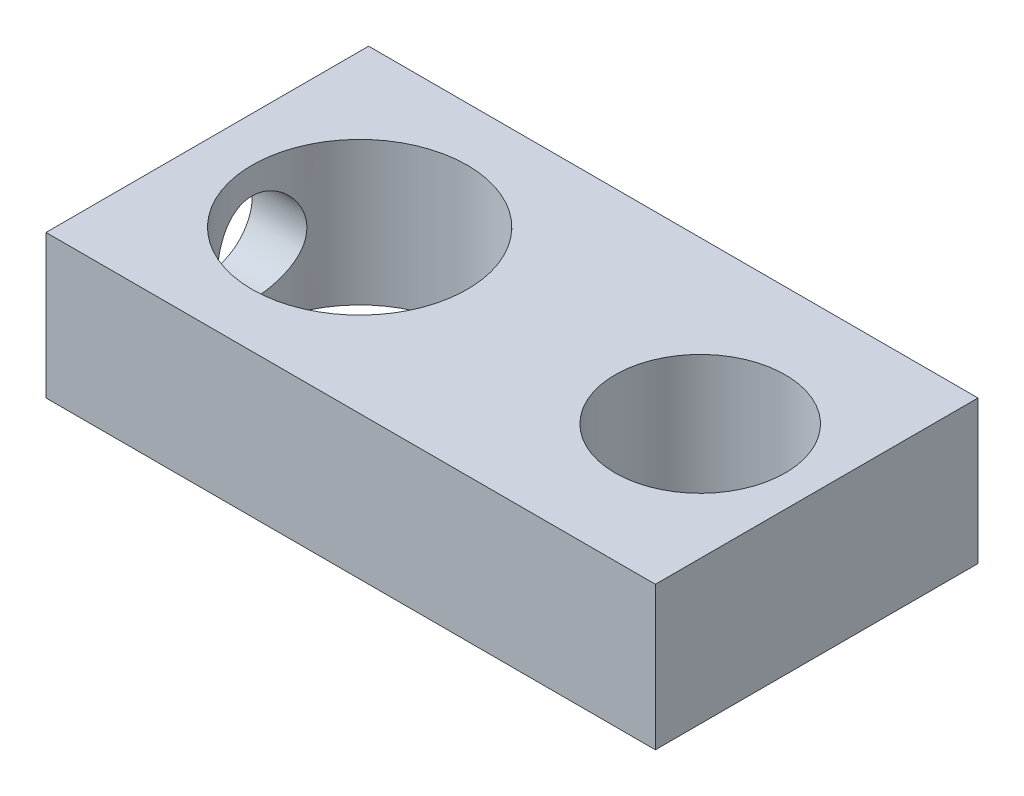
ISO-10303-21;
HEADER;
FILE_DESCRIPTION(('STEP AP214'),'2;1');
FILE_NAME('part.step','',(''),(''),'','','');
FILE_SCHEMA(('AUTOMOTIVE_DESIGN { 1 0 10303 214 1 1 1 1 }'));
ENDSEC;
DATA;
#1=APPLICATION_CONTEXT('core data for automotive mechanical design processes');
#2=APPLICATION_PROTOCOL_DEFINITION('international standard','automotive_design',2000,#1);
#3=PRODUCT_CONTEXT('',#1,'mechanical');
#4=PRODUCT('Part','Part','',(#3));
#5=PRODUCT_RELATED_PRODUCT_CATEGORY('part','',(#4));
#6=PRODUCT_DEFINITION_FORMATION('','',#4);
#7=PRODUCT_DEFINITION_CONTEXT('part definition',#1,'design');
#8=PRODUCT_DEFINITION('design','',#6,#7);
#9=PRODUCT_DEFINITION_SHAPE('','',#8);
#10=(LENGTH_UNIT() NAMED_UNIT(*) SI_UNIT(.MILLI.,.METRE.));
#11=(NAMED_UNIT(*) PLANE_ANGLE_UNIT() SI_UNIT($,.RADIAN.));
#12=(NAMED_UNIT(*) SI_UNIT($,.STERADIAN.) SOLID_ANGLE_UNIT());
#13=UNCERTAINTY_MEASURE_WITH_UNIT(LENGTH_MEASURE(1.E-05),#10,'distance_accuracy_value','');
#14=(GEOMETRIC_REPRESENTATION_CONTEXT(3) GLOBAL_UNCERTAINTY_ASSIGNED_CONTEXT((#13)) GLOBAL_UNIT_ASSIGNED_CONTEXT((#10,
#11,#12)) REPRESENTATION_CONTEXT('',''));
#15=CARTESIAN_POINT('',(0.,0.,0.));
#16=DIRECTION('',(0.,0.,1.));
#17=DIRECTION('',(1.,0.,0.));
#18=AXIS2_PLACEMENT_3D('',#15,#16,#17);
#19=CARTESIAN_POINT('',(-13.49375,12.6999999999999,14.2875));
#20=DIRECTION('',(0.,-1.,0.));
#21=DIRECTION('',(0.,0.,-1.));
#22=AXIS2_PLACEMENT_3D('',#19,#20,#21);
#23=PLANE('',#22);
#24=CARTESIAN_POINT('',(0.,12.6999999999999,0.));
#25=DIRECTION('',(0.,1.,0.));
#26=DIRECTION('',(0.,0.,1.));
#27=AXIS2_PLACEMENT_3D('',#24,#25,#26);
#28=CIRCLE('',#27,9.53262);
#29=CARTESIAN_POINT('',(0.,12.6999999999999,9.53262000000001));
#30=VERTEX_POINT('',#29);
#31=EDGE_CURVE('E100',#30,#30,#28,.T.);
#32=ORIENTED_EDGE('',*,*,#31,.F.);
#33=EDGE_LOOP('',(#32));
#34=FACE_BOUND('',#33,.T.);
#35=DIRECTION('',(0.,0.,1.));
#36=VECTOR('',#35,1.);
#37=CARTESIAN_POINT('',(-13.49375,12.6999999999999,14.2875));
#38=LINE('',#37,#36);
#39=CARTESIAN_POINT('',(-13.49375,12.6999999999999,-14.2875000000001));
#40=VERTEX_POINT('',#39);
#41=CARTESIAN_POINT('',(-13.49375,12.6999999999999,14.2875));
#42=VERTEX_POINT('',#41);
#43=EDGE_CURVE('E115',#40,#42,#38,.T.);
#44=ORIENTED_EDGE('',*,*,#43,.T.);
#45=DIRECTION('',(1.,0.,0.));
#46=VECTOR('',#45,1.);
#47=CARTESIAN_POINT('',(-13.49375,12.6999999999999,14.2875));
#48=LINE('',#47,#46);
#49=CARTESIAN_POINT('',(40.4812500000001,12.6999999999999,14.2875));
#50=VERTEX_POINT('',#49);
#51=EDGE_CURVE('E94',#42,#50,#48,.T.);
#52=ORIENTED_EDGE('',*,*,#51,.T.);
#53=DIRECTION('',(0.,0.,-1.));
#54=VECTOR('',#53,1.);
#55=CARTESIAN_POINT('',(40.4812500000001,12.6999999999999,-14.2875));
#56=LINE('',#55,#54);
#57=CARTESIAN_POINT('',(40.4812500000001,12.6999999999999,-14.2875));
#58=VERTEX_POINT('',#57);
#59=EDGE_CURVE('E59',#50,#58,#56,.T.);
#60=ORIENTED_EDGE('',*,*,#59,.T.);
#61=DIRECTION('',(-1.,0.,0.));
#62=VECTOR('',#61,1.);
#63=CARTESIAN_POINT('',(-13.49375,12.6999999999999,-14.2875000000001));
#64=LINE('',#63,#62);
#65=EDGE_CURVE('E54',#58,#40,#64,.T.);
#66=ORIENTED_EDGE('',*,*,#65,.T.);
#67=EDGE_LOOP('',(#44,#52,#60,#66));
#68=FACE_BOUND('',#67,.T.);
#69=CARTESIAN_POINT('',(30.1625,12.6999999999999,0.));
#70=DIRECTION('',(0.,1.,0.));
#71=DIRECTION('',(0.,0.,1.));
#72=AXIS2_PLACEMENT_3D('',#69,#70,#71);
#73=CIRCLE('',#72,7.53618);
#74=CARTESIAN_POINT('',(30.1625,12.6999999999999,7.53617999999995));
#75=VERTEX_POINT('',#74);
#76=EDGE_CURVE('E140',#75,#75,#73,.T.);
#77=ORIENTED_EDGE('',*,*,#76,.F.);
#78=EDGE_LOOP('',(#77));
#79=FACE_BOUND('',#78,.T.);
#80=ADVANCED_FACE('F32',(#34,#68,#79),#23,.F.);
#81=CARTESIAN_POINT('',(-13.49375,0.,14.2875));
#82=DIRECTION('',(0.,-1.,0.));
#83=DIRECTION('',(0.,0.,-1.));
#84=AXIS2_PLACEMENT_3D('',#81,#82,#83);
#85=PLANE('',#84);
#86=CARTESIAN_POINT('',(0.,0.,0.));
#87=DIRECTION('',(0.,1.,0.));
#88=DIRECTION('',(0.,0.,1.));
#89=AXIS2_PLACEMENT_3D('',#86,#87,#88);
#90=CIRCLE('',#89,9.53262);
#91=CARTESIAN_POINT('',(0.,0.,9.53262000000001));
#92=VERTEX_POINT('',#91);
#93=EDGE_CURVE('E107',#92,#92,#90,.T.);
#94=ORIENTED_EDGE('',*,*,#93,.T.);
#95=EDGE_LOOP('',(#94));
#96=FACE_BOUND('',#95,.T.);
#97=DIRECTION('',(0.,0.,1.));
#98=VECTOR('',#97,1.);
#99=CARTESIAN_POINT('',(-13.49375,0.,14.2875));
#100=LINE('',#99,#98);
#101=CARTESIAN_POINT('',(-13.49375,0.,-14.2875000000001));
#102=VERTEX_POINT('',#101);
#103=CARTESIAN_POINT('',(-13.49375,0.,14.2875));
#104=VERTEX_POINT('',#103);
#105=EDGE_CURVE('E85',#102,#104,#100,.T.);
#106=ORIENTED_EDGE('',*,*,#105,.F.);
#107=DIRECTION('',(-1.,0.,0.));
#108=VECTOR('',#107,1.);
#109=CARTESIAN_POINT('',(-13.49375,0.,-14.2875000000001));
#110=LINE('',#109,#108);
#111=CARTESIAN_POINT('',(40.4812500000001,0.,-14.2875000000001));
#112=VERTEX_POINT('',#111);
#113=EDGE_CURVE('E112',#112,#102,#110,.T.);
#114=ORIENTED_EDGE('',*,*,#113,.F.);
#115=DIRECTION('',(0.,0.,-1.));
#116=VECTOR('',#115,1.);
#117=CARTESIAN_POINT('',(40.4812500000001,0.,-14.2875000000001));
#118=LINE('',#117,#116);
#119=CARTESIAN_POINT('',(40.4812500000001,0.,14.2875));
#120=VERTEX_POINT('',#119);
#121=EDGE_CURVE('E86',#120,#112,#118,.T.);
#122=ORIENTED_EDGE('',*,*,#121,.F.);
#123=DIRECTION('',(1.,0.,0.));
#124=VECTOR('',#123,1.);
#125=CARTESIAN_POINT('',(-13.49375,0.,14.2875));
#126=LINE('',#125,#124);
#127=EDGE_CURVE('E80',#104,#120,#126,.T.);
#128=ORIENTED_EDGE('',*,*,#127,.F.);
#129=EDGE_LOOP('',(#106,#114,#122,#128));
#130=FACE_BOUND('',#129,.T.);
#131=CARTESIAN_POINT('',(30.1625,0.,0.));
#132=DIRECTION('',(0.,1.,0.));
#133=DIRECTION('',(0.,0.,1.));
#134=AXIS2_PLACEMENT_3D('',#131,#132,#133);
#135=CIRCLE('',#134,7.53618);
#136=CARTESIAN_POINT('',(30.1625,0.,7.53617999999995));
#137=VERTEX_POINT('',#136);
#138=EDGE_CURVE('E143',#137,#137,#135,.T.);
#139=ORIENTED_EDGE('',*,*,#138,.T.);
#140=EDGE_LOOP('',(#139));
#141=FACE_BOUND('',#140,.T.);
#142=ADVANCED_FACE('F81',(#96,#130,#141),#85,.T.);
#143=CARTESIAN_POINT('',(-13.49375,12.6999999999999,14.2875));
#144=DIRECTION('',(1.,0.,0.));
#145=DIRECTION('',(0.,0.,-1.));
#146=AXIS2_PLACEMENT_3D('',#143,#144,#145);
#147=PLANE('',#146);
#148=CARTESIAN_POINT('',(-13.49375,6.35000000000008,0.));
#149=DIRECTION('',(-1.,0.,0.));
#150=DIRECTION('',(0.,0.,1.));
#151=AXIS2_PLACEMENT_3D('',#148,#149,#150);
#152=CIRCLE('',#151,3.9878);
#153=CARTESIAN_POINT('',(-13.49375,6.35000000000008,3.98779999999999));
#154=VERTEX_POINT('',#153);
#155=EDGE_CURVE('E153',#154,#154,#152,.T.);
#156=ORIENTED_EDGE('',*,*,#155,.F.);
#157=EDGE_LOOP('',(#156));
#158=FACE_BOUND('',#157,.T.);
#159=ORIENTED_EDGE('',*,*,#105,.T.);
#160=DIRECTION('',(0.,-1.,0.));
#161=VECTOR('',#160,1.);
#162=CARTESIAN_POINT('',(-13.49375,12.6999999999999,14.2875));
#163=LINE('',#162,#161);
#164=EDGE_CURVE('E11',#42,#104,#163,.T.);
#165=ORIENTED_EDGE('',*,*,#164,.F.);
#166=ORIENTED_EDGE('',*,*,#43,.F.);
#167=DIRECTION('',(0.,-1.,0.));
#168=VECTOR('',#167,1.);
#169=CARTESIAN_POINT('',(-13.49375,12.6999999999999,-14.2875000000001));
#170=LINE('',#169,#168);
#171=EDGE_CURVE('E98',#40,#102,#170,.T.);
#172=ORIENTED_EDGE('',*,*,#171,.T.);
#173=EDGE_LOOP('',(#159,#165,#166,#172));
#174=FACE_BOUND('',#173,.T.);
#175=ADVANCED_FACE('F34',(#158,#174),#147,.F.);
#176=CARTESIAN_POINT('',(-13.49375,12.6999999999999,14.2875));
#177=DIRECTION('',(0.,0.,-1.));
#178=DIRECTION('',(-1.,0.,0.));
#179=AXIS2_PLACEMENT_3D('',#176,#177,#178);
#180=PLANE('',#179);
#181=ORIENTED_EDGE('',*,*,#127,.T.);
#182=DIRECTION('',(0.,-1.,0.));
#183=VECTOR('',#182,1.);
#184=CARTESIAN_POINT('',(40.4812500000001,12.6999999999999,14.2875));
#185=LINE('',#184,#183);
#186=EDGE_CURVE('E47',#50,#120,#185,.T.);
#187=ORIENTED_EDGE('',*,*,#186,.F.);
#188=ORIENTED_EDGE('',*,*,#51,.F.);
#189=ORIENTED_EDGE('',*,*,#164,.T.);
#190=EDGE_LOOP('',(#181,#187,#188,#189));
#191=FACE_BOUND('',#190,.T.);
#192=ADVANCED_FACE('F93',(#191),#180,.F.);
#193=CARTESIAN_POINT('',(40.4812500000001,12.6999999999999,-14.2875));
#194=DIRECTION('',(-1.,0.,0.));
#195=DIRECTION('',(0.,0.,1.));
#196=AXIS2_PLACEMENT_3D('',#193,#194,#195);
#197=PLANE('',#196);
#198=ORIENTED_EDGE('',*,*,#121,.T.);
#199=DIRECTION('',(0.,-1.,0.));
#200=VECTOR('',#199,1.);
#201=CARTESIAN_POINT('',(40.4812500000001,12.6999999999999,-14.2875));
#202=LINE('',#201,#200);
#203=EDGE_CURVE('E123',#58,#112,#202,.T.);
#204=ORIENTED_EDGE('',*,*,#203,.F.);
#205=ORIENTED_EDGE('',*,*,#59,.F.);
#206=ORIENTED_EDGE('',*,*,#186,.T.);
#207=EDGE_LOOP('',(#198,#204,#205,#206));
#208=FACE_BOUND('',#207,.T.);
#209=ADVANCED_FACE('F131',(#208),#197,.F.);
#210=CARTESIAN_POINT('',(-13.49375,12.6999999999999,-14.2875000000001));
#211=DIRECTION('',(0.,0.,1.));
#212=DIRECTION('',(1.,0.,0.));
#213=AXIS2_PLACEMENT_3D('',#210,#211,#212);
#214=PLANE('',#213);
#215=ORIENTED_EDGE('',*,*,#113,.T.);
#216=ORIENTED_EDGE('',*,*,#171,.F.);
#217=ORIENTED_EDGE('',*,*,#65,.F.);
#218=ORIENTED_EDGE('',*,*,#203,.T.);
#219=EDGE_LOOP('',(#215,#216,#217,#218));
#220=FACE_BOUND('',#219,.T.);
#221=ADVANCED_FACE('F133',(#220),#214,.F.);
#222=CARTESIAN_POINT('',(0.,12.6999999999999,0.));
#223=DIRECTION('',(0.,-1.,0.));
#224=DIRECTION('',(0.,0.,-1.));
#225=AXIS2_PLACEMENT_3D('',#222,#223,#224);
#226=CYLINDRICAL_SURFACE('',#225,9.53262);
#227=CARTESIAN_POINT('',(-8.65842336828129,6.35000000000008,3.98779999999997));
#228=CARTESIAN_POINT('',(-8.65842416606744,6.24364850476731,3.9877992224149));
#229=CARTESIAN_POINT('',(-8.66038974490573,6.13725943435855,3.98353913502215));
#230=CARTESIAN_POINT('',(-8.66818681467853,5.92525746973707,3.96654329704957));
#231=CARTESIAN_POINT('',(-8.67402081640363,5.81964512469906,3.95380204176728));
#232=CARTESIAN_POINT('',(-8.6893740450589,5.60980372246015,3.91994516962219));
#233=CARTESIAN_POINT('',(-8.69890106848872,5.505578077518,3.89881183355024));
#234=CARTESIAN_POINT('',(-8.72131774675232,5.29947002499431,3.84840396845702));
#235=CARTESIAN_POINT('',(-8.73420881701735,5.19758862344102,3.81912601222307));
#236=CARTESIAN_POINT('',(-8.77720692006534,4.89740949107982,3.71977542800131));
#237=CARTESIAN_POINT('',(-8.81172636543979,4.70347365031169,3.63800489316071));
#238=CARTESIAN_POINT('',(-8.88856326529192,4.3322294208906,3.44599985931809));
#239=CARTESIAN_POINT('',(-8.9308789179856,4.15491720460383,3.3357719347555));
#240=CARTESIAN_POINT('',(-9.02151716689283,3.81058934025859,3.08255361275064));
#241=CARTESIAN_POINT('',(-9.07004454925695,3.64473344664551,2.93805603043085));
#242=CARTESIAN_POINT('',(-9.16595452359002,3.3387570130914,2.62357269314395));
#243=CARTESIAN_POINT('',(-9.21333666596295,3.19864644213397,2.45357711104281));
#244=CARTESIAN_POINT('',(-9.30410937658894,2.94218781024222,2.08378222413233));
#245=CARTESIAN_POINT('',(-9.34723435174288,2.82714873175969,1.88300389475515));
#246=CARTESIAN_POINT('',(-9.4221256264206,2.63298296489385,1.46281474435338));
#247=CARTESIAN_POINT('',(-9.45389700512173,2.55384021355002,1.24341230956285));
#248=CARTESIAN_POINT('',(-9.50104928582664,2.43792937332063,0.804398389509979));
#249=CARTESIAN_POINT('',(-9.51720188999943,2.39915795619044,0.58540042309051));
#250=CARTESIAN_POINT('',(-9.53410124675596,2.35861500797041,0.14345148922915));
#251=CARTESIAN_POINT('',(-9.53485430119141,2.35682834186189,-0.0794978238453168));
#252=CARTESIAN_POINT('',(-9.52132247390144,2.38926080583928,-0.508445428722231));
#253=CARTESIAN_POINT('',(-9.50795714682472,2.42127815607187,-0.714644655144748));
#254=CARTESIAN_POINT('',(-9.46895546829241,2.51663246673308,-1.11843031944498));
#255=CARTESIAN_POINT('',(-9.44331821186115,2.57997173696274,-1.31601612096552));
#256=CARTESIAN_POINT('',(-9.38175658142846,2.7369218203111,-1.70059540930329));
#257=CARTESIAN_POINT('',(-9.34568112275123,2.83098004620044,-1.88738111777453));
#258=CARTESIAN_POINT('',(-9.26676814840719,3.04625753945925,-2.24300729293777));
#259=CARTESIAN_POINT('',(-9.22392823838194,3.16748643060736,-2.41184136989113));
#260=CARTESIAN_POINT('',(-9.13219174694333,3.44366820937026,-2.73950529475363));
#261=CARTESIAN_POINT('',(-9.08308109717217,3.60040394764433,-2.8967746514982));
#262=CARTESIAN_POINT('',(-8.98661592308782,3.93812635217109,-3.18347418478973));
#263=CARTESIAN_POINT('',(-8.93926209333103,4.11912248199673,-3.31289344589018));
#264=CARTESIAN_POINT('',(-8.85013643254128,4.50785008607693,-3.54427038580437));
#265=CARTESIAN_POINT('',(-8.80860346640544,4.71627193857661,-3.64516812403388));
#266=CARTESIAN_POINT('',(-8.73867255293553,5.14934716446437,-3.80979535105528));
#267=CARTESIAN_POINT('',(-8.71026512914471,5.37398869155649,-3.87355166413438));
#268=CARTESIAN_POINT('',(-8.67215722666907,5.81748539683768,-3.95810054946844));
#269=CARTESIAN_POINT('',(-8.66135707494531,6.03576172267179,-3.98142503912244));
#270=CARTESIAN_POINT('',(-8.65654195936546,6.47332963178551,-3.99188978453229));
#271=CARTESIAN_POINT('',(-8.66252111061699,6.69262083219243,-3.97904272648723));
#272=CARTESIAN_POINT('',(-8.68945401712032,7.11102643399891,-3.91984013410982));
#273=CARTESIAN_POINT('',(-8.70941289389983,7.31052778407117,-3.87570859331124));
#274=CARTESIAN_POINT('',(-8.76078126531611,7.6991265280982,-3.7581431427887));
#275=CARTESIAN_POINT('',(-8.79219345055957,7.88822146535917,-3.68470234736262));
#276=CARTESIAN_POINT('',(-8.86455526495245,8.25962662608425,-3.50714119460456));
#277=CARTESIAN_POINT('',(-8.90585360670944,8.44130658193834,-3.40184921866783));
#278=CARTESIAN_POINT('',(-8.99284246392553,8.78529702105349,-3.16473704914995));
#279=CARTESIAN_POINT('',(-9.03853488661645,8.94759902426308,-3.03290530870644));
#280=CARTESIAN_POINT('',(-9.13369502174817,9.26211085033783,-2.73368664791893));
#281=CARTESIAN_POINT('',(-9.18316437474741,9.41239492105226,-2.56426803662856));
#282=CARTESIAN_POINT('',(-9.27682132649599,9.68275098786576,-2.20147473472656));
#283=CARTESIAN_POINT('',(-9.32100851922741,9.80282066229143,-2.00809820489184));
#284=CARTESIAN_POINT('',(-9.39942506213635,10.0092432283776,-1.60143678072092));
#285=CARTESIAN_POINT('',(-9.43362546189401,10.0954983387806,-1.38809632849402));
#286=CARTESIAN_POINT('',(-9.48793383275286,10.2302622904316,-0.948133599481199));
#287=CARTESIAN_POINT('',(-9.50805026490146,10.2787937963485,-0.721519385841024));
#288=CARTESIAN_POINT('',(-9.53094382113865,10.3338619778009,-0.278648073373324));
#289=CARTESIAN_POINT('',(-9.53484138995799,10.3431132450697,-0.0627841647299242));
#290=CARTESIAN_POINT('',(-9.52796580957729,10.3266695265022,0.367346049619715));
#291=CARTESIAN_POINT('',(-9.51719526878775,10.3009807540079,0.581612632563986));
#292=CARTESIAN_POINT('',(-9.48278481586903,10.2173353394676,0.994517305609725));
#293=CARTESIAN_POINT('',(-9.45962178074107,10.1605726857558,1.1934403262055));
#294=CARTESIAN_POINT('',(-9.40297937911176,10.0176986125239,1.57886084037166));
#295=CARTESIAN_POINT('',(-9.36949806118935,9.93158164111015,1.76535597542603));
#296=CARTESIAN_POINT('',(-9.29357256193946,9.72809083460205,2.12992847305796));
#297=CARTESIAN_POINT('',(-9.25079126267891,9.60947854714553,2.30724262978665));
#298=CARTESIAN_POINT('',(-9.16132639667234,9.34615058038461,2.64021122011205));
#299=CARTESIAN_POINT('',(-9.11464137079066,9.20142511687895,2.79585749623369));
#300=CARTESIAN_POINT('',(-9.01860202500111,8.87829991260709,3.09217856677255));
#301=CARTESIAN_POINT('',(-8.96928460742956,8.69827001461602,3.23109076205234));
#302=CARTESIAN_POINT('',(-8.87684626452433,8.31580068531,3.4770378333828));
#303=CARTESIAN_POINT('',(-8.83372882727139,8.11334875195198,3.58405480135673));
#304=CARTESIAN_POINT('',(-8.77797291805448,7.79750310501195,3.71757032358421));
#305=CARTESIAN_POINT('',(-8.76089762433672,7.69040171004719,3.75752493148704));
#306=CARTESIAN_POINT('',(-8.73024799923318,7.47272523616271,3.82819856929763));
#307=CARTESIAN_POINT('',(-8.71667194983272,7.36215189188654,3.85892213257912));
#308=CARTESIAN_POINT('',(-8.69355945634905,7.13867479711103,3.91071226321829));
#309=CARTESIAN_POINT('',(-8.68401235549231,7.02577803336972,3.93180431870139));
#310=CARTESIAN_POINT('',(-8.66928332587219,6.79836169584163,3.96417600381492));
#311=CARTESIAN_POINT('',(-8.66409800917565,6.6838434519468,3.97546324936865));
#312=CARTESIAN_POINT('',(-8.66027106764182,6.53257728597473,3.98378598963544));
#313=CARTESIAN_POINT('',(-8.65957864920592,6.49608312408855,3.98529080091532));
#314=CARTESIAN_POINT('',(-8.65865466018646,6.42306078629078,3.98729794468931));
#315=CARTESIAN_POINT('',(-8.65842309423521,6.38653261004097,3.98780026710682));
#316=CARTESIAN_POINT('',(-8.65842336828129,6.35000000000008,3.98779999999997));
#317=B_SPLINE_CURVE_WITH_KNOTS('',3,(#227,#228,#229,#230,#231,#232,#233,#234,#235,#236,#237,
#238,#239,#240,#241,#242,#243,#244,#245,#246,#247,#248,#249,#250,#251,#252,#253,#254,#255,#256,
#257,#258,#259,#260,#261,#262,#263,#264,#265,#266,#267,#268,#269,#270,#271,#272,#273,#274,#275,
#276,#277,#278,#279,#280,#281,#282,#283,#284,#285,#286,#287,#288,#289,#290,#291,#292,#293,#294,
#295,#296,#297,#298,#299,#300,#301,#302,#303,#304,#305,#306,#307,#308,#309,#310,#311,#312,#313,
#314,#315,#316),.UNSPECIFIED.,.T.,.F.,(4,2,2,2,2,2,2,2,2,2,2,2,2,2,2,2,2,2,2,2,2,2,2,2,2,2,2,2,
2,2,2,2,2,2,2,2,2,2,2,2,2,2,2,2,4),(0.,0.319016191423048,0.638239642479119,0.958140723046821,
1.2781766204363,1.91492673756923,2.55152987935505,3.22435181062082,3.89743372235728,
4.59998524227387,5.30222207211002,5.9676575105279,6.63282063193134,7.25718437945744,
7.88159417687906,8.51553728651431,9.14970529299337,9.82888239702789,10.5083252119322,
11.2104303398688,11.9120277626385,12.5678463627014,13.2234349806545,13.8365657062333,
14.4498405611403,15.0891893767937,15.7288169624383,16.4210136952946,17.1132636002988,
17.8075007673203,18.5013205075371,19.1463212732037,19.7912073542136,20.4128954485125,
21.0347011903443,21.6846544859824,22.334851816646,23.0297079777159,23.7249535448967,
24.0713024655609,24.4174810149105,24.7627380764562,25.1077267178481,25.2173102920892,
25.3268949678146),.UNSPECIFIED.);
#318=CARTESIAN_POINT('',(-8.65842336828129,6.35000000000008,3.98779999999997));
#319=VERTEX_POINT('',#318);
#320=EDGE_CURVE('E36',#319,#319,#317,.T.);
#321=ORIENTED_EDGE('',*,*,#320,.F.);
#322=EDGE_LOOP('',(#321));
#323=FACE_BOUND('',#322,.T.);
#324=ORIENTED_EDGE('',*,*,#31,.T.);
#325=EDGE_LOOP('',(#324));
#326=FACE_BOUND('',#325,.T.);
#327=ORIENTED_EDGE('',*,*,#93,.F.);
#328=EDGE_LOOP('',(#327));
#329=FACE_BOUND('',#328,.T.);
#330=ADVANCED_FACE('F165',(#323,#326,#329),#226,.F.);
#331=CARTESIAN_POINT('',(30.1625,12.6999999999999,0.));
#332=DIRECTION('',(0.,-1.,0.));
#333=DIRECTION('',(0.,0.,-1.));
#334=AXIS2_PLACEMENT_3D('',#331,#332,#333);
#335=CYLINDRICAL_SURFACE('',#334,7.53618);
#336=ORIENTED_EDGE('',*,*,#76,.T.);
#337=EDGE_LOOP('',(#336));
#338=FACE_BOUND('',#337,.T.);
#339=ORIENTED_EDGE('',*,*,#138,.F.);
#340=EDGE_LOOP('',(#339));
#341=FACE_BOUND('',#340,.T.);
#342=ADVANCED_FACE('F168',(#338,#341),#335,.F.);
#343=CARTESIAN_POINT('',(-0.79375000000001,6.35000000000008,0.));
#344=DIRECTION('',(-1.,0.,0.));
#345=DIRECTION('',(0.,0.,1.));
#346=AXIS2_PLACEMENT_3D('',#343,#344,#345);
#347=CYLINDRICAL_SURFACE('',#346,3.9878);
#348=ORIENTED_EDGE('',*,*,#320,.T.);
#349=EDGE_LOOP('',(#348));
#350=FACE_BOUND('',#349,.T.);
#351=ORIENTED_EDGE('',*,*,#155,.T.);
#352=EDGE_LOOP('',(#351));
#353=FACE_BOUND('',#352,.T.);
#354=ADVANCED_FACE('F163',(#350,#353),#347,.F.);
#355=CLOSED_SHELL('',(#80,#142,#175,#192,#209,#221,#330,#342,#354));
#356=MANIFOLD_SOLID_BREP('B2',#355);
#357=ADVANCED_BREP_SHAPE_REPRESENTATION('',(#18,#356),#14);
#358=SHAPE_DEFINITION_REPRESENTATION(#9,#357);
ENDSEC;
END-ISO-10303-21;
